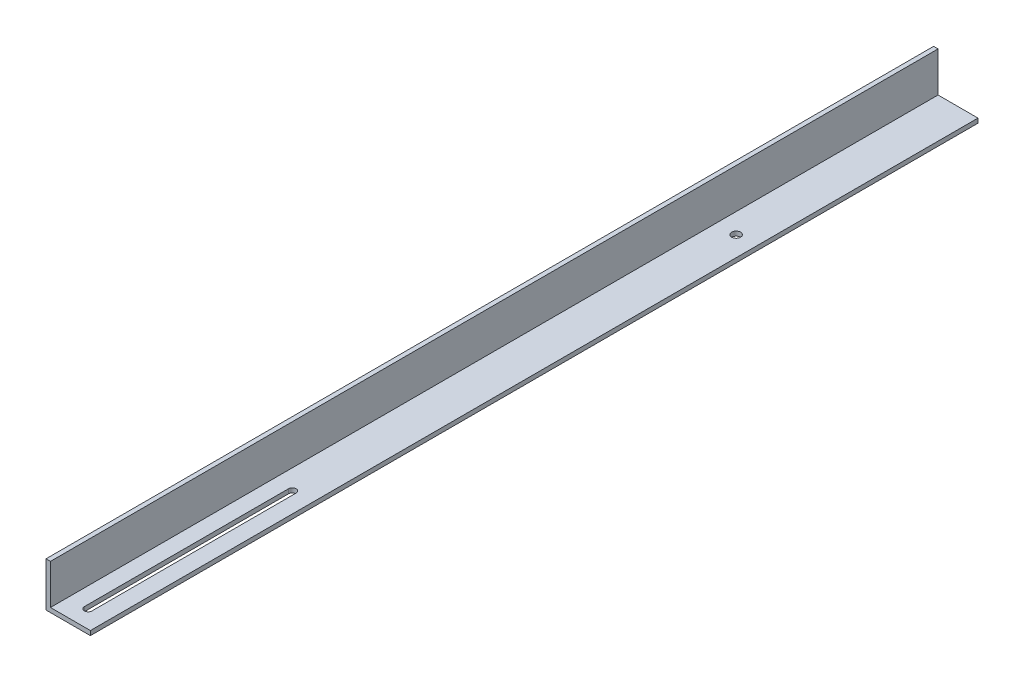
from build123d import *

# Parameters (mm, degrees)
AUFSATZ_LINEAR_AUSTRAGEN1_DEPTH  = 1000
F_10_0_10_DURCHMESSER_BOHRUNG1_D = 10
SCHNITT_LINEAR_AUSTRAGEN1_REACH  = 1004.26


with BuildPart() as part:
    # Skizze1 → Aufsatz-Linear austragen1 (new body)
    with BuildSketch(Plane.XY):
        Polygon((0, 0), (0, 50), (5, 50), (5, 5), (50, 5), (50, 0), align=None)
    extrude(amount=-AUFSATZ_LINEAR_AUSTRAGEN1_DEPTH)

    # 10.0 _10_ Durchmesser Bohrung1 (through all)
    with Locations(Plane(origin=(0, 5, 0), x_dir=(-1, 0, 0), z_dir=(0, 1, 0))):
        with Locations((-27.5, -750)):
            Hole(F_10_0_10_DURCHMESSER_BOHRUNG1_D / 2)

    # Skizze6 → Schnitt-Linear austragen1 (cut, up to next)
    with BuildSketch(Plane(origin=(0, 5, 0), x_dir=(1, 0, 0), z_dir=(0, 1, 0)), mode=Mode.PRIVATE) as schnitt_linear_austragen1_sk1:
        with BuildLine():
            Line((23.25, 20), (23.25, 250))
            ThreePointArc((23.25, 250), (27.5, 254.25), (31.75, 250))
            Line((31.75, 250), (31.75, 20))
            ThreePointArc((31.75, 20), (27.5, 15.75), (23.25, 20))
        make_face()
    schnitt_linear_austragen1_tool1 = extrude(schnitt_linear_austragen1_sk1.sketch, amount=-SCHNITT_LINEAR_AUSTRAGEN1_REACH, mode=Mode.PRIVATE) & part.part
    add(schnitt_linear_austragen1_tool1.solids().sort_by_distance((27.5, 5, -135))[0], mode=Mode.SUBTRACT)


solid = part.part
